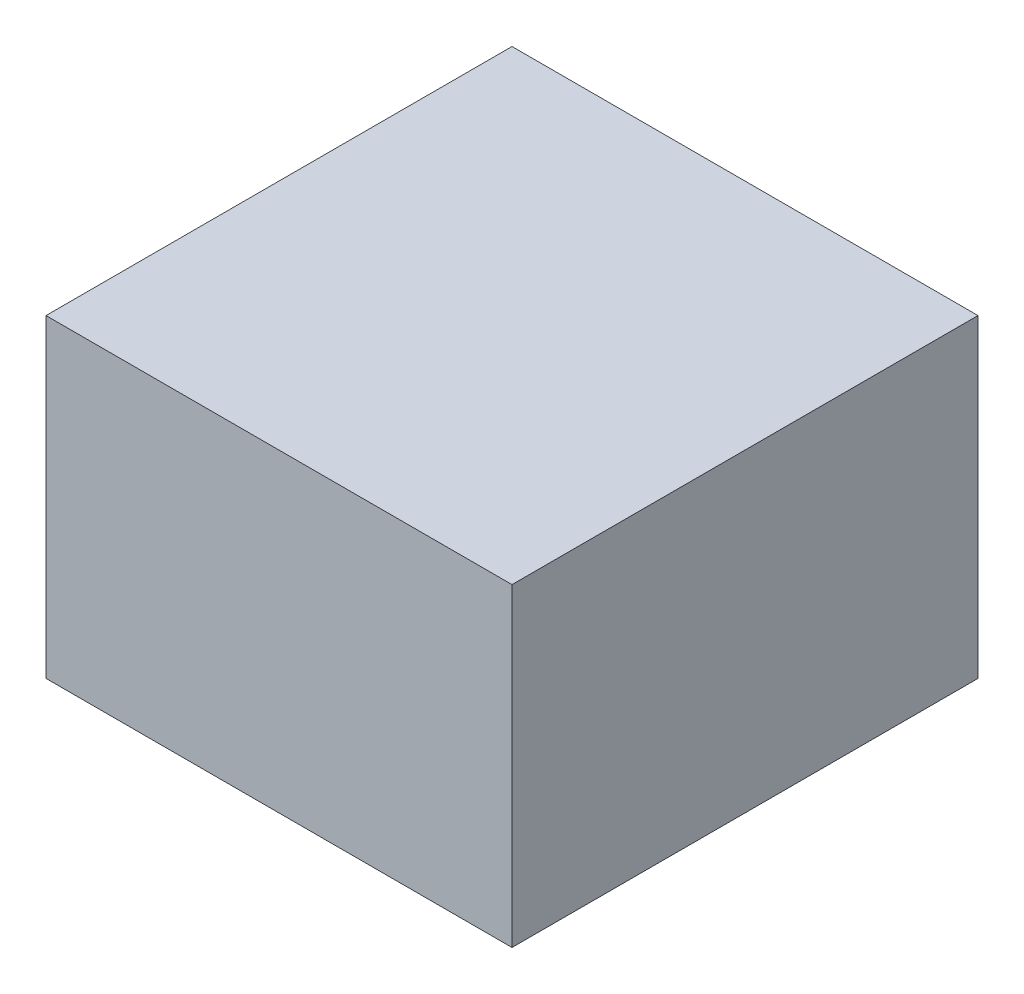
from build123d import *

# Parameters (mm, degrees)
SKETCH1_W           = 43
SKETCH1_H           = 43
BOSS_EXTRUDE1_DEPTH = 29


with BuildPart() as part:
    # Sketch1 → Boss-Extrude1 (new body)
    with BuildSketch(Plane(origin=(0, 0, 0), x_dir=(1, 0, 0), z_dir=(0, 1, 0))):
        with Locations((21.5, 21.5)):
            Rectangle(SKETCH1_W, SKETCH1_H)
    extrude(amount=BOSS_EXTRUDE1_DEPTH)


solid = part.part
